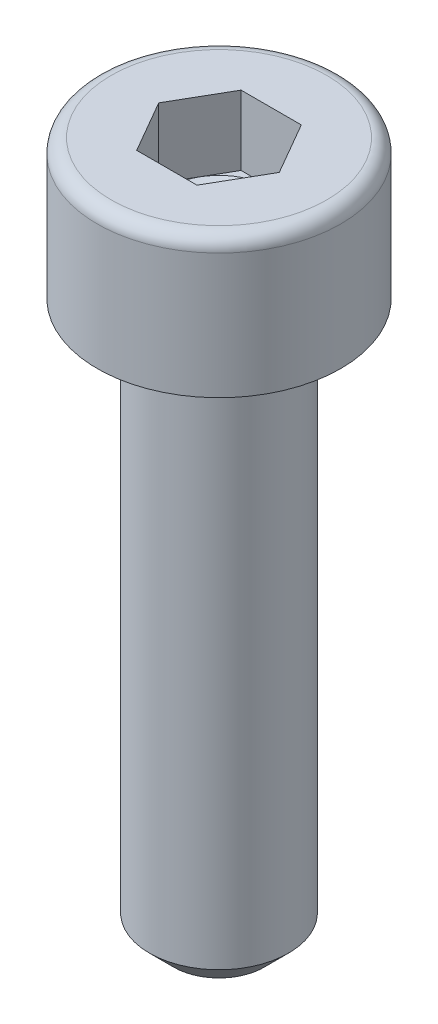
ISO-10303-21;
HEADER;
FILE_DESCRIPTION(('STEP AP214'),'2;1');
FILE_NAME('part.step','',(''),(''),'','','');
FILE_SCHEMA(('AUTOMOTIVE_DESIGN { 1 0 10303 214 1 1 1 1 }'));
ENDSEC;
DATA;
#1=APPLICATION_CONTEXT('core data for automotive mechanical design processes');
#2=APPLICATION_PROTOCOL_DEFINITION('international standard','automotive_design',2000,#1);
#3=PRODUCT_CONTEXT('',#1,'mechanical');
#4=PRODUCT('Part','Part','',(#3));
#5=PRODUCT_RELATED_PRODUCT_CATEGORY('part','',(#4));
#6=PRODUCT_DEFINITION_FORMATION('','',#4);
#7=PRODUCT_DEFINITION_CONTEXT('part definition',#1,'design');
#8=PRODUCT_DEFINITION('design','',#6,#7);
#9=PRODUCT_DEFINITION_SHAPE('','',#8);
#10=(LENGTH_UNIT() NAMED_UNIT(*) SI_UNIT(.MILLI.,.METRE.));
#11=(NAMED_UNIT(*) PLANE_ANGLE_UNIT() SI_UNIT($,.RADIAN.));
#12=(NAMED_UNIT(*) SI_UNIT($,.STERADIAN.) SOLID_ANGLE_UNIT());
#13=UNCERTAINTY_MEASURE_WITH_UNIT(LENGTH_MEASURE(1.E-05),#10,'distance_accuracy_value','');
#14=(GEOMETRIC_REPRESENTATION_CONTEXT(3) GLOBAL_UNCERTAINTY_ASSIGNED_CONTEXT((#13)) GLOBAL_UNIT_ASSIGNED_CONTEXT((#10,
#11,#12)) REPRESENTATION_CONTEXT('',''));
#15=CARTESIAN_POINT('',(0.,0.,0.));
#16=DIRECTION('',(0.,0.,1.));
#17=DIRECTION('',(1.,0.,0.));
#18=AXIS2_PLACEMENT_3D('',#15,#16,#17);
#19=CARTESIAN_POINT('',(-2.59807621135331,2.,1.5));
#20=DIRECTION('',(0.,-1.,0.));
#21=DIRECTION('',(0.,0.,-1.));
#22=AXIS2_PLACEMENT_3D('',#19,#20,#21);
#23=PLANE('',#22);
#24=DIRECTION('',(-0.499999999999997,0.,-0.86602540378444));
#25=VECTOR('',#24,1.);
#26=CARTESIAN_POINT('',(-0.866025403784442,2.,1.5));
#27=LINE('',#26,#25);
#28=CARTESIAN_POINT('',(-1.29903810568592,2.00000000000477,0.750000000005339));
#29=VERTEX_POINT('',#28);
#30=CARTESIAN_POINT('',(-1.73205080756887,2.,0.));
#31=VERTEX_POINT('',#30);
#32=EDGE_CURVE('E116',#29,#31,#27,.T.);
#33=ORIENTED_EDGE('',*,*,#32,.F.);
#34=CARTESIAN_POINT('',(0.,2.00000000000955,0.));
#35=DIRECTION('',(0.,1.,0.));
#36=DIRECTION('',(0.,0.,1.));
#37=AXIS2_PLACEMENT_3D('',#34,#35,#36);
#38=CIRCLE('',#37,1.50000000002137);
#39=CARTESIAN_POINT('',(-1.29903810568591,2.00000000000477,-0.75000000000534));
#40=VERTEX_POINT('',#39);
#41=EDGE_CURVE('E91',#29,#40,#38,.F.);
#42=ORIENTED_EDGE('',*,*,#41,.T.);
#43=DIRECTION('',(0.499999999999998,0.,-0.86602540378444));
#44=VECTOR('',#43,1.);
#45=CARTESIAN_POINT('',(-0.866025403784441,2.,-1.5));
#46=LINE('',#45,#44);
#47=EDGE_CURVE('E117',#31,#40,#46,.T.);
#48=ORIENTED_EDGE('',*,*,#47,.F.);
#49=EDGE_LOOP('',(#33,#42,#48));
#50=FACE_BOUND('',#49,.T.);
#51=ADVANCED_FACE('F16',(#50),#23,.F.);
#52=CARTESIAN_POINT('',(-2.59807621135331,2.,1.5));
#53=DIRECTION('',(0.,-1.,0.));
#54=DIRECTION('',(0.,0.,-1.));
#55=AXIS2_PLACEMENT_3D('',#52,#53,#54);
#56=PLANE('',#55);
#57=DIRECTION('',(-1.,0.,0.));
#58=VECTOR('',#57,1.);
#59=CARTESIAN_POINT('',(0.866025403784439,2.,1.5));
#60=LINE('',#59,#58);
#61=CARTESIAN_POINT('',(0.,2.00000000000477,1.50000000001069));
#62=VERTEX_POINT('',#61);
#63=CARTESIAN_POINT('',(-0.866025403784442,2.,1.5));
#64=VERTEX_POINT('',#63);
#65=EDGE_CURVE('E112',#62,#64,#60,.T.);
#66=ORIENTED_EDGE('',*,*,#65,.F.);
#67=CARTESIAN_POINT('',(0.,2.00000000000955,0.));
#68=DIRECTION('',(0.,1.,0.));
#69=DIRECTION('',(0.,0.,1.));
#70=AXIS2_PLACEMENT_3D('',#67,#68,#69);
#71=CIRCLE('',#70,1.50000000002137);
#72=EDGE_CURVE('E95',#29,#62,#71,.T.);
#73=ORIENTED_EDGE('',*,*,#72,.F.);
#74=DIRECTION('',(-0.499999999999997,0.,-0.86602540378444));
#75=VECTOR('',#74,1.);
#76=CARTESIAN_POINT('',(-0.866025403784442,2.,1.5));
#77=LINE('',#76,#75);
#78=EDGE_CURVE('E109',#64,#29,#77,.T.);
#79=ORIENTED_EDGE('',*,*,#78,.F.);
#80=EDGE_LOOP('',(#66,#73,#79));
#81=FACE_BOUND('',#80,.T.);
#82=ADVANCED_FACE('F107',(#81),#56,.F.);
#83=CARTESIAN_POINT('',(-0.866025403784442,2.,1.5));
#84=DIRECTION('',(0.86602540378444,0.,-0.499999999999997));
#85=DIRECTION('',(-0.499999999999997,0.,-0.86602540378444));
#86=AXIS2_PLACEMENT_3D('',#83,#84,#85);
#87=PLANE('',#86);
#88=ORIENTED_EDGE('',*,*,#32,.T.);
#89=DIRECTION('',(0.,1.,0.));
#90=VECTOR('',#89,1.);
#91=CARTESIAN_POINT('',(-1.73205080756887,2.,0.));
#92=LINE('',#91,#90);
#93=CARTESIAN_POINT('',(-1.73205080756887,4.,0.));
#94=VERTEX_POINT('',#93);
#95=EDGE_CURVE('E136',#94,#31,#92,.F.);
#96=ORIENTED_EDGE('',*,*,#95,.F.);
#97=DIRECTION('',(-0.499999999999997,0.,-0.86602540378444));
#98=VECTOR('',#97,1.);
#99=CARTESIAN_POINT('',(-0.866025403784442,4.,1.5));
#100=LINE('',#99,#98);
#101=CARTESIAN_POINT('',(-0.866025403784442,4.,1.5));
#102=VERTEX_POINT('',#101);
#103=EDGE_CURVE('E114',#94,#102,#100,.F.);
#104=ORIENTED_EDGE('',*,*,#103,.T.);
#105=DIRECTION('',(0.,1.,0.));
#106=VECTOR('',#105,1.);
#107=CARTESIAN_POINT('',(-0.866025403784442,2.,1.5));
#108=LINE('',#107,#106);
#109=EDGE_CURVE('E126',#64,#102,#108,.T.);
#110=ORIENTED_EDGE('',*,*,#109,.F.);
#111=ORIENTED_EDGE('',*,*,#78,.T.);
#112=EDGE_LOOP('',(#88,#96,#104,#110,#111));
#113=FACE_BOUND('',#112,.T.);
#114=ADVANCED_FACE('F123',(#113),#87,.T.);
#115=CARTESIAN_POINT('',(-0.866025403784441,2.,-1.5));
#116=DIRECTION('',(0.86602540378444,0.,0.499999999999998));
#117=DIRECTION('',(0.499999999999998,0.,-0.86602540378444));
#118=AXIS2_PLACEMENT_3D('',#115,#116,#117);
#119=PLANE('',#118);
#120=DIRECTION('',(0.499999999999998,0.,-0.86602540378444));
#121=VECTOR('',#120,1.);
#122=CARTESIAN_POINT('',(-1.29903810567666,2.,-0.749999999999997));
#123=LINE('',#122,#121);
#124=CARTESIAN_POINT('',(-0.866025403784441,2.,-1.5));
#125=VERTEX_POINT('',#124);
#126=EDGE_CURVE('E103',#40,#125,#123,.T.);
#127=ORIENTED_EDGE('',*,*,#126,.T.);
#128=DIRECTION('',(0.,1.,0.));
#129=VECTOR('',#128,1.);
#130=CARTESIAN_POINT('',(-0.866025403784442,2.,-1.5));
#131=LINE('',#130,#129);
#132=CARTESIAN_POINT('',(-0.866025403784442,4.,-1.5));
#133=VERTEX_POINT('',#132);
#134=EDGE_CURVE('E245',#133,#125,#131,.F.);
#135=ORIENTED_EDGE('',*,*,#134,.F.);
#136=DIRECTION('',(0.499999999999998,0.,-0.86602540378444));
#137=VECTOR('',#136,1.);
#138=CARTESIAN_POINT('',(-0.866025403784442,4.,-1.5));
#139=LINE('',#138,#137);
#140=EDGE_CURVE('E121',#133,#94,#139,.F.);
#141=ORIENTED_EDGE('',*,*,#140,.T.);
#142=ORIENTED_EDGE('',*,*,#95,.T.);
#143=ORIENTED_EDGE('',*,*,#47,.T.);
#144=EDGE_LOOP('',(#127,#135,#141,#142,#143));
#145=FACE_BOUND('',#144,.T.);
#146=ADVANCED_FACE('F405',(#145),#119,.T.);
#147=CARTESIAN_POINT('',(-2.59807621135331,2.,1.5));
#148=DIRECTION('',(0.,-1.,0.));
#149=DIRECTION('',(0.,0.,-1.));
#150=AXIS2_PLACEMENT_3D('',#147,#148,#149);
#151=PLANE('',#150);
#152=ORIENTED_EDGE('',*,*,#126,.F.);
#153=CARTESIAN_POINT('',(0.,2.00000000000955,0.));
#154=DIRECTION('',(0.,1.,0.));
#155=DIRECTION('',(0.,0.,1.));
#156=AXIS2_PLACEMENT_3D('',#153,#154,#155);
#157=CIRCLE('',#156,1.50000000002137);
#158=CARTESIAN_POINT('',(0.,2.00000000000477,-1.50000000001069));
#159=VERTEX_POINT('',#158);
#160=EDGE_CURVE('E98',#40,#159,#157,.F.);
#161=ORIENTED_EDGE('',*,*,#160,.T.);
#162=DIRECTION('',(1.,0.,0.));
#163=VECTOR('',#162,1.);
#164=CARTESIAN_POINT('',(0.866025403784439,2.,-1.5));
#165=LINE('',#164,#163);
#166=EDGE_CURVE('E163',#125,#159,#165,.T.);
#167=ORIENTED_EDGE('',*,*,#166,.F.);
#168=EDGE_LOOP('',(#152,#161,#167));
#169=FACE_BOUND('',#168,.T.);
#170=ADVANCED_FACE('F397',(#169),#151,.F.);
#171=CARTESIAN_POINT('',(0.,2.00000000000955,0.));
#172=DIRECTION('',(0.,1.,0.));
#173=DIRECTION('',(0.,0.,1.));
#174=AXIS2_PLACEMENT_3D('',#171,#172,#173);
#175=CONICAL_SURFACE('',#174,1.50000000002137,1.0471975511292);
#176=CARTESIAN_POINT('',(-4.2632564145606E-11,1.13397459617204,0.));
#177=VERTEX_POINT('',#176);
#178=VERTEX_LOOP('',#177);
#179=FACE_BOUND('',#178,.T.);
#180=CARTESIAN_POINT('',(0.,2.00000000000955,0.));
#181=DIRECTION('',(0.,1.,0.));
#182=DIRECTION('',(0.,0.,1.));
#183=AXIS2_PLACEMENT_3D('',#180,#181,#182);
#184=CIRCLE('',#183,1.50000000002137);
#185=CARTESIAN_POINT('',(1.29903810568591,2.00000000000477,0.750000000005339));
#186=VERTEX_POINT('',#185);
#187=EDGE_CURVE('E150',#62,#186,#184,.T.);
#188=ORIENTED_EDGE('',*,*,#187,.T.);
#189=CARTESIAN_POINT('',(0.,2.00000000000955,0.));
#190=DIRECTION('',(0.,1.,0.));
#191=DIRECTION('',(0.,0.,1.));
#192=AXIS2_PLACEMENT_3D('',#189,#190,#191);
#193=CIRCLE('',#192,1.50000000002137);
#194=CARTESIAN_POINT('',(1.29903810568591,2.00000000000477,-0.75000000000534));
#195=VERTEX_POINT('',#194);
#196=EDGE_CURVE('E165',#195,#186,#193,.F.);
#197=ORIENTED_EDGE('',*,*,#196,.F.);
#198=CARTESIAN_POINT('',(0.,2.00000000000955,0.));
#199=DIRECTION('',(0.,1.,0.));
#200=DIRECTION('',(0.,0.,1.));
#201=AXIS2_PLACEMENT_3D('',#198,#199,#200);
#202=CIRCLE('',#201,1.50000000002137);
#203=EDGE_CURVE('E160',#195,#159,#202,.T.);
#204=ORIENTED_EDGE('',*,*,#203,.T.);
#205=ORIENTED_EDGE('',*,*,#160,.F.);
#206=ORIENTED_EDGE('',*,*,#41,.F.);
#207=ORIENTED_EDGE('',*,*,#72,.T.);
#208=EDGE_LOOP('',(#188,#197,#204,#205,#206,#207));
#209=FACE_BOUND('',#208,.T.);
#210=ADVANCED_FACE('F94',(#179,#209),#175,.F.);
#211=CARTESIAN_POINT('',(-2.59807621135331,2.,1.5));
#212=DIRECTION('',(0.,-1.,0.));
#213=DIRECTION('',(0.,0.,-1.));
#214=AXIS2_PLACEMENT_3D('',#211,#212,#213);
#215=PLANE('',#214);
#216=DIRECTION('',(-0.499999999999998,0.,0.86602540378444));
#217=VECTOR('',#216,1.);
#218=CARTESIAN_POINT('',(0.866025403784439,2.,1.5));
#219=LINE('',#218,#217);
#220=CARTESIAN_POINT('',(0.866025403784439,2.,1.5));
#221=VERTEX_POINT('',#220);
#222=EDGE_CURVE('E233',#186,#221,#219,.T.);
#223=ORIENTED_EDGE('',*,*,#222,.F.);
#224=ORIENTED_EDGE('',*,*,#187,.F.);
#225=DIRECTION('',(-1.,0.,0.));
#226=VECTOR('',#225,1.);
#227=CARTESIAN_POINT('',(0.866025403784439,2.,1.5));
#228=LINE('',#227,#226);
#229=EDGE_CURVE('E149',#221,#62,#228,.T.);
#230=ORIENTED_EDGE('',*,*,#229,.F.);
#231=EDGE_LOOP('',(#223,#224,#230));
#232=FACE_BOUND('',#231,.T.);
#233=ADVANCED_FACE('F282',(#232),#215,.F.);
#234=CARTESIAN_POINT('',(0.866025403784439,2.,1.5));
#235=DIRECTION('',(0.,0.,-1.));
#236=DIRECTION('',(-1.,0.,0.));
#237=AXIS2_PLACEMENT_3D('',#234,#235,#236);
#238=PLANE('',#237);
#239=ORIENTED_EDGE('',*,*,#65,.T.);
#240=ORIENTED_EDGE('',*,*,#109,.T.);
#241=DIRECTION('',(-1.,0.,0.));
#242=VECTOR('',#241,1.);
#243=CARTESIAN_POINT('',(0.866025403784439,4.,1.5));
#244=LINE('',#243,#242);
#245=CARTESIAN_POINT('',(0.866025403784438,4.,1.5));
#246=VERTEX_POINT('',#245);
#247=EDGE_CURVE('E146',#102,#246,#244,.F.);
#248=ORIENTED_EDGE('',*,*,#247,.T.);
#249=DIRECTION('',(0.,1.,0.));
#250=VECTOR('',#249,1.);
#251=CARTESIAN_POINT('',(0.866025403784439,2.,1.5));
#252=LINE('',#251,#250);
#253=EDGE_CURVE('E239',#221,#246,#252,.T.);
#254=ORIENTED_EDGE('',*,*,#253,.F.);
#255=ORIENTED_EDGE('',*,*,#229,.T.);
#256=EDGE_LOOP('',(#239,#240,#248,#254,#255));
#257=FACE_BOUND('',#256,.T.);
#258=ADVANCED_FACE('F278',(#257),#238,.T.);
#259=CARTESIAN_POINT('',(0.866025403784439,2.,-1.5));
#260=DIRECTION('',(0.,0.,1.));
#261=DIRECTION('',(1.,0.,0.));
#262=AXIS2_PLACEMENT_3D('',#259,#260,#261);
#263=PLANE('',#262);
#264=DIRECTION('',(1.,0.,0.));
#265=VECTOR('',#264,1.);
#266=CARTESIAN_POINT('',(-2.59807621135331,2.,-1.5));
#267=LINE('',#266,#265);
#268=CARTESIAN_POINT('',(0.866025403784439,2.,-1.5));
#269=VERTEX_POINT('',#268);
#270=EDGE_CURVE('E162',#159,#269,#267,.T.);
#271=ORIENTED_EDGE('',*,*,#270,.T.);
#272=DIRECTION('',(0.,1.,0.));
#273=VECTOR('',#272,1.);
#274=CARTESIAN_POINT('',(0.866025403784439,2.,-1.5));
#275=LINE('',#274,#273);
#276=CARTESIAN_POINT('',(0.866025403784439,4.,-1.5));
#277=VERTEX_POINT('',#276);
#278=EDGE_CURVE('E218',#277,#269,#275,.F.);
#279=ORIENTED_EDGE('',*,*,#278,.F.);
#280=DIRECTION('',(1.,0.,0.));
#281=VECTOR('',#280,1.);
#282=CARTESIAN_POINT('',(0.866025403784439,4.,-1.5));
#283=LINE('',#282,#281);
#284=EDGE_CURVE('E242',#277,#133,#283,.F.);
#285=ORIENTED_EDGE('',*,*,#284,.T.);
#286=ORIENTED_EDGE('',*,*,#134,.T.);
#287=ORIENTED_EDGE('',*,*,#166,.T.);
#288=EDGE_LOOP('',(#271,#279,#285,#286,#287));
#289=FACE_BOUND('',#288,.T.);
#290=ADVANCED_FACE('F299',(#289),#263,.T.);
#291=CARTESIAN_POINT('',(-2.59807621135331,2.,1.5));
#292=DIRECTION('',(0.,-1.,0.));
#293=DIRECTION('',(0.,0.,-1.));
#294=AXIS2_PLACEMENT_3D('',#291,#292,#293);
#295=PLANE('',#294);
#296=ORIENTED_EDGE('',*,*,#270,.F.);
#297=ORIENTED_EDGE('',*,*,#203,.F.);
#298=DIRECTION('',(0.499999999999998,0.,0.86602540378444));
#299=VECTOR('',#298,1.);
#300=CARTESIAN_POINT('',(0.866025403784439,2.,-1.5));
#301=LINE('',#300,#299);
#302=EDGE_CURVE('E209',#269,#195,#301,.T.);
#303=ORIENTED_EDGE('',*,*,#302,.F.);
#304=EDGE_LOOP('',(#296,#297,#303));
#305=FACE_BOUND('',#304,.T.);
#306=ADVANCED_FACE('F303',(#305),#295,.F.);
#307=CARTESIAN_POINT('',(-2.59807621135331,2.,1.5));
#308=DIRECTION('',(0.,-1.,0.));
#309=DIRECTION('',(0.,0.,-1.));
#310=AXIS2_PLACEMENT_3D('',#307,#308,#309);
#311=PLANE('',#310);
#312=DIRECTION('',(0.499999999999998,0.,0.86602540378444));
#313=VECTOR('',#312,1.);
#314=CARTESIAN_POINT('',(0.866025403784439,2.,-1.5));
#315=LINE('',#314,#313);
#316=CARTESIAN_POINT('',(1.73205080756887,2.,0.));
#317=VERTEX_POINT('',#316);
#318=EDGE_CURVE('E217',#195,#317,#315,.T.);
#319=ORIENTED_EDGE('',*,*,#318,.F.);
#320=ORIENTED_EDGE('',*,*,#196,.T.);
#321=DIRECTION('',(-0.499999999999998,0.,0.86602540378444));
#322=VECTOR('',#321,1.);
#323=CARTESIAN_POINT('',(0.866025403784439,2.,1.5));
#324=LINE('',#323,#322);
#325=EDGE_CURVE('E230',#317,#186,#324,.T.);
#326=ORIENTED_EDGE('',*,*,#325,.F.);
#327=EDGE_LOOP('',(#319,#320,#326));
#328=FACE_BOUND('',#327,.T.);
#329=ADVANCED_FACE('F304',(#328),#311,.F.);
#330=CARTESIAN_POINT('',(0.866025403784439,2.,1.5));
#331=DIRECTION('',(-0.86602540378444,0.,-0.499999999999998));
#332=DIRECTION('',(-0.499999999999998,0.,0.86602540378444));
#333=AXIS2_PLACEMENT_3D('',#330,#331,#332);
#334=PLANE('',#333);
#335=ORIENTED_EDGE('',*,*,#222,.T.);
#336=ORIENTED_EDGE('',*,*,#253,.T.);
#337=DIRECTION('',(-0.499999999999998,0.,0.86602540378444));
#338=VECTOR('',#337,1.);
#339=CARTESIAN_POINT('',(0.866025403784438,4.,1.5));
#340=LINE('',#339,#338);
#341=CARTESIAN_POINT('',(1.73205080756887,4.,0.));
#342=VERTEX_POINT('',#341);
#343=EDGE_CURVE('E234',#246,#342,#340,.F.);
#344=ORIENTED_EDGE('',*,*,#343,.T.);
#345=DIRECTION('',(0.,1.,0.));
#346=VECTOR('',#345,1.);
#347=CARTESIAN_POINT('',(1.73205080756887,2.,0.));
#348=LINE('',#347,#346);
#349=EDGE_CURVE('E223',#317,#342,#348,.T.);
#350=ORIENTED_EDGE('',*,*,#349,.F.);
#351=ORIENTED_EDGE('',*,*,#325,.T.);
#352=EDGE_LOOP('',(#335,#336,#344,#350,#351));
#353=FACE_BOUND('',#352,.T.);
#354=ADVANCED_FACE('F293',(#353),#334,.T.);
#355=CARTESIAN_POINT('',(0.866025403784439,2.,-1.5));
#356=DIRECTION('',(-0.86602540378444,0.,0.499999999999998));
#357=DIRECTION('',(0.499999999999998,0.,0.86602540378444));
#358=AXIS2_PLACEMENT_3D('',#355,#356,#357);
#359=PLANE('',#358);
#360=ORIENTED_EDGE('',*,*,#318,.T.);
#361=ORIENTED_EDGE('',*,*,#349,.T.);
#362=DIRECTION('',(-0.499999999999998,0.,-0.86602540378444));
#363=VECTOR('',#362,1.);
#364=CARTESIAN_POINT('',(1.73205080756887,4.,0.));
#365=LINE('',#364,#363);
#366=EDGE_CURVE('E173',#342,#277,#365,.T.);
#367=ORIENTED_EDGE('',*,*,#366,.T.);
#368=ORIENTED_EDGE('',*,*,#278,.T.);
#369=ORIENTED_EDGE('',*,*,#302,.T.);
#370=EDGE_LOOP('',(#360,#361,#367,#368,#369));
#371=FACE_BOUND('',#370,.T.);
#372=ADVANCED_FACE('F194',(#371),#359,.T.);
#373=CARTESIAN_POINT('',(1.5,4.,0.));
#374=DIRECTION('',(0.,-1.,0.));
#375=DIRECTION('',(1.,0.,0.));
#376=AXIS2_PLACEMENT_3D('',#373,#374,#375);
#377=PLANE('',#376);
#378=ORIENTED_EDGE('',*,*,#343,.F.);
#379=ORIENTED_EDGE('',*,*,#247,.F.);
#380=ORIENTED_EDGE('',*,*,#103,.F.);
#381=ORIENTED_EDGE('',*,*,#140,.F.);
#382=ORIENTED_EDGE('',*,*,#284,.F.);
#383=ORIENTED_EDGE('',*,*,#366,.F.);
#384=EDGE_LOOP('',(#378,#379,#380,#381,#382,#383));
#385=FACE_BOUND('',#384,.T.);
#386=CARTESIAN_POINT('',(0.,4.,0.));
#387=DIRECTION('',(0.,-1.,0.));
#388=DIRECTION('',(-1.,0.,0.));
#389=AXIS2_PLACEMENT_3D('',#386,#387,#388);
#390=CIRCLE('',#389,3.1);
#391=CARTESIAN_POINT('',(-3.1,4.,0.));
#392=VERTEX_POINT('',#391);
#393=CARTESIAN_POINT('',(3.1,4.,0.));
#394=VERTEX_POINT('',#393);
#395=EDGE_CURVE('E36',#392,#394,#390,.T.);
#396=ORIENTED_EDGE('',*,*,#395,.F.);
#397=CARTESIAN_POINT('',(0.,4.,0.));
#398=DIRECTION('',(0.,-1.,0.));
#399=DIRECTION('',(1.,0.,0.));
#400=AXIS2_PLACEMENT_3D('',#397,#398,#399);
#401=CIRCLE('',#400,3.1);
#402=EDGE_CURVE('E171',#394,#392,#401,.T.);
#403=ORIENTED_EDGE('',*,*,#402,.F.);
#404=EDGE_LOOP('',(#396,#403));
#405=FACE_BOUND('',#404,.T.);
#406=ADVANCED_FACE('F175',(#385,#405),#377,.F.);
#407=CARTESIAN_POINT('',(0.,3.6,0.));
#408=DIRECTION('',(0.,1.,0.));
#409=DIRECTION('',(-1.,0.,0.));
#410=AXIS2_PLACEMENT_3D('',#407,#408,#409);
#411=TOROIDAL_SURFACE('',#410,3.1,0.4);
#412=ORIENTED_EDGE('',*,*,#395,.T.);
#413=ORIENTED_EDGE('',*,*,#402,.T.);
#414=EDGE_LOOP('',(#412,#413));
#415=FACE_BOUND('',#414,.T.);
#416=CARTESIAN_POINT('',(0.,3.6,0.));
#417=DIRECTION('',(0.,1.,0.));
#418=DIRECTION('',(-1.,0.,0.));
#419=AXIS2_PLACEMENT_3D('',#416,#417,#418);
#420=CIRCLE('',#419,3.5);
#421=CARTESIAN_POINT('',(-3.5,3.6,0.));
#422=VERTEX_POINT('',#421);
#423=EDGE_CURVE('E159',#422,#422,#420,.F.);
#424=ORIENTED_EDGE('',*,*,#423,.F.);
#425=EDGE_LOOP('',(#424));
#426=FACE_BOUND('',#425,.T.);
#427=ADVANCED_FACE('F169',(#415,#426),#411,.T.);
#428=CARTESIAN_POINT('',(0.,-16.,0.));
#429=DIRECTION('',(0.,1.,0.));
#430=DIRECTION('',(0.,0.,1.));
#431=AXIS2_PLACEMENT_3D('',#428,#429,#430);
#432=PLANE('',#431);
#433=CARTESIAN_POINT('',(0.,-15.9999999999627,0.));
#434=DIRECTION('',(0.,1.,0.));
#435=DIRECTION('',(0.,0.,1.));
#436=AXIS2_PLACEMENT_3D('',#433,#434,#435);
#437=CIRCLE('',#436,1.30000000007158);
#438=CARTESIAN_POINT('',(0.,-15.9999999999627,1.30000000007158));
#439=VERTEX_POINT('',#438);
#440=EDGE_CURVE('E156',#439,#439,#437,.T.);
#441=ORIENTED_EDGE('',*,*,#440,.F.);
#442=EDGE_LOOP('',(#441));
#443=FACE_BOUND('',#442,.T.);
#444=ADVANCED_FACE('F201',(#443),#432,.F.);
#445=CARTESIAN_POINT('',(0.,4.,0.));
#446=DIRECTION('',(0.,1.,0.));
#447=DIRECTION('',(-1.,0.,0.));
#448=AXIS2_PLACEMENT_3D('',#445,#446,#447);
#449=CYLINDRICAL_SURFACE('',#448,3.5);
#450=ORIENTED_EDGE('',*,*,#423,.T.);
#451=EDGE_LOOP('',(#450));
#452=FACE_BOUND('',#451,.T.);
#453=CARTESIAN_POINT('',(0.,0.,0.));
#454=DIRECTION('',(0.,1.,0.));
#455=DIRECTION('',(-1.,0.,0.));
#456=AXIS2_PLACEMENT_3D('',#453,#454,#455);
#457=CIRCLE('',#456,3.5);
#458=CARTESIAN_POINT('',(-3.5,0.,0.));
#459=VERTEX_POINT('',#458);
#460=EDGE_CURVE('E153',#459,#459,#457,.T.);
#461=ORIENTED_EDGE('',*,*,#460,.T.);
#462=EDGE_LOOP('',(#461));
#463=FACE_BOUND('',#462,.T.);
#464=ADVANCED_FACE('F330',(#452,#463),#449,.T.);
#465=CARTESIAN_POINT('',(0.,-15.3000000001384,0.));
#466=DIRECTION('',(0.,1.,0.));
#467=DIRECTION('',(0.,0.,1.));
#468=AXIS2_PLACEMENT_3D('',#465,#466,#467);
#469=CONICAL_SURFACE('',#468,1.99999999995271,0.785398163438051);
#470=ORIENTED_EDGE('',*,*,#440,.T.);
#471=EDGE_LOOP('',(#470));
#472=FACE_BOUND('',#471,.T.);
#473=CARTESIAN_POINT('',(0.,-15.3,0.));
#474=DIRECTION('',(0.,1.,0.));
#475=DIRECTION('',(0.,0.,1.));
#476=AXIS2_PLACEMENT_3D('',#473,#474,#475);
#477=CIRCLE('',#476,2.);
#478=CARTESIAN_POINT('',(0.,-15.3,2.));
#479=VERTEX_POINT('',#478);
#480=EDGE_CURVE('E28',#479,#479,#477,.T.);
#481=ORIENTED_EDGE('',*,*,#480,.F.);
#482=EDGE_LOOP('',(#481));
#483=FACE_BOUND('',#482,.T.);
#484=ADVANCED_FACE('F319',(#472,#483),#469,.T.);
#485=CARTESIAN_POINT('',(0.,0.,0.));
#486=DIRECTION('',(0.,1.,0.));
#487=DIRECTION('',(-1.,0.,0.));
#488=AXIS2_PLACEMENT_3D('',#485,#486,#487);
#489=PLANE('',#488);
#490=ORIENTED_EDGE('',*,*,#460,.F.);
#491=EDGE_LOOP('',(#490));
#492=FACE_BOUND('',#491,.T.);
#493=CARTESIAN_POINT('',(0.,0.,0.));
#494=DIRECTION('',(0.,1.,0.));
#495=DIRECTION('',(0.,0.,1.));
#496=AXIS2_PLACEMENT_3D('',#493,#494,#495);
#497=CIRCLE('',#496,2.);
#498=CARTESIAN_POINT('',(0.,0.,2.));
#499=VERTEX_POINT('',#498);
#500=EDGE_CURVE('E10',#499,#499,#497,.F.);
#501=ORIENTED_EDGE('',*,*,#500,.F.);
#502=EDGE_LOOP('',(#501));
#503=FACE_BOUND('',#502,.T.);
#504=ADVANCED_FACE('F314',(#492,#503),#489,.F.);
#505=CARTESIAN_POINT('',(0.,-16.,0.));
#506=DIRECTION('',(0.,1.,0.));
#507=DIRECTION('',(0.,0.,1.));
#508=AXIS2_PLACEMENT_3D('',#505,#506,#507);
#509=CYLINDRICAL_SURFACE('',#508,2.);
#510=ORIENTED_EDGE('',*,*,#480,.T.);
#511=EDGE_LOOP('',(#510));
#512=FACE_BOUND('',#511,.T.);
#513=ORIENTED_EDGE('',*,*,#500,.T.);
#514=EDGE_LOOP('',(#513));
#515=FACE_BOUND('',#514,.T.);
#516=ADVANCED_FACE('F18',(#512,#515),#509,.T.);
#517=CLOSED_SHELL('',(#51,#82,#114,#146,#170,#210,#233,#258,#290,#306,#329,#354,#372,#406,#427,
#444,#464,#484,#504,#516));
#518=MANIFOLD_SOLID_BREP('B1',#517);
#519=ADVANCED_BREP_SHAPE_REPRESENTATION('',(#18,#518),#14);
#520=SHAPE_DEFINITION_REPRESENTATION(#9,#519);
ENDSEC;
END-ISO-10303-21;
